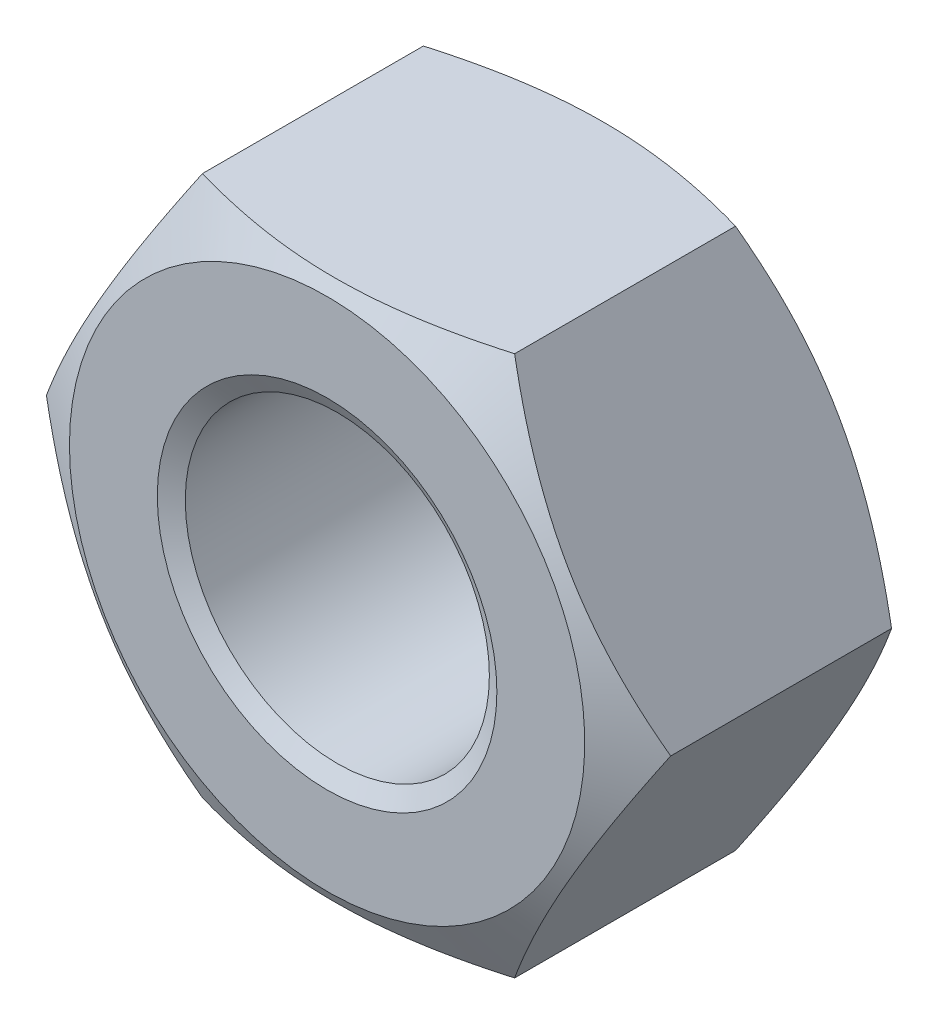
ISO-10303-21;
HEADER;
FILE_DESCRIPTION(('STEP AP214'),'2;1');
FILE_NAME('part.step','',(''),(''),'','','');
FILE_SCHEMA(('AUTOMOTIVE_DESIGN { 1 0 10303 214 1 1 1 1 }'));
ENDSEC;
DATA;
#1=APPLICATION_CONTEXT('core data for automotive mechanical design processes');
#2=APPLICATION_PROTOCOL_DEFINITION('international standard','automotive_design',2000,#1);
#3=PRODUCT_CONTEXT('',#1,'mechanical');
#4=PRODUCT('Part','Part','',(#3));
#5=PRODUCT_RELATED_PRODUCT_CATEGORY('part','',(#4));
#6=PRODUCT_DEFINITION_FORMATION('','',#4);
#7=PRODUCT_DEFINITION_CONTEXT('part definition',#1,'design');
#8=PRODUCT_DEFINITION('design','',#6,#7);
#9=PRODUCT_DEFINITION_SHAPE('','',#8);
#10=(LENGTH_UNIT() NAMED_UNIT(*) SI_UNIT(.MILLI.,.METRE.));
#11=(NAMED_UNIT(*) PLANE_ANGLE_UNIT() SI_UNIT($,.RADIAN.));
#12=(NAMED_UNIT(*) SI_UNIT($,.STERADIAN.) SOLID_ANGLE_UNIT());
#13=UNCERTAINTY_MEASURE_WITH_UNIT(LENGTH_MEASURE(1.E-05),#10,'distance_accuracy_value','');
#14=(GEOMETRIC_REPRESENTATION_CONTEXT(3) GLOBAL_UNCERTAINTY_ASSIGNED_CONTEXT((#13)) GLOBAL_UNIT_ASSIGNED_CONTEXT((#10,
#11,#12)) REPRESENTATION_CONTEXT('',''));
#15=CARTESIAN_POINT('',(0.,0.,0.));
#16=DIRECTION('',(0.,0.,1.));
#17=DIRECTION('',(1.,0.,0.));
#18=AXIS2_PLACEMENT_3D('',#15,#16,#17);
#19=CARTESIAN_POINT('',(-4.61880215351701,-8.,-8.4));
#20=DIRECTION('',(0.,-1.,0.));
#21=DIRECTION('',(0.,0.,-1.));
#22=AXIS2_PLACEMENT_3D('',#19,#20,#21);
#23=PLANE('',#22);
#24=CARTESIAN_POINT('',(-12.2197397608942,-8.,-4.03022141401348));
#25=CARTESIAN_POINT('',(-11.868727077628,-8.,-3.86071753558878));
#26=CARTESIAN_POINT('',(-11.5168810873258,-8.,-3.69290788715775));
#27=CARTESIAN_POINT('',(-10.811071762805,-8.,-3.36164590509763));
#28=CARTESIAN_POINT('',(-10.4571080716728,-8.,-3.19819433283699));
#29=CARTESIAN_POINT('',(-9.74468564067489,-8.,-2.87574971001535));
#30=CARTESIAN_POINT('',(-9.38621274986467,-8.,-2.71678781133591));
#31=CARTESIAN_POINT('',(-8.66630957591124,-8.,-2.40573517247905));
#32=CARTESIAN_POINT('',(-8.30487944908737,-8.,-2.25364407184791));
#33=CARTESIAN_POINT('',(-7.5741397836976,-8.,-1.95641301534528));
#34=CARTESIAN_POINT('',(-7.20478765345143,-8.,-1.81137718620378));
#35=CARTESIAN_POINT('',(-6.46171720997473,-8.,-1.53273971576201));
#36=CARTESIAN_POINT('',(-6.08799841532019,-8.,-1.39913934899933));
#37=CARTESIAN_POINT('',(-5.33637311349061,-8.,-1.14698509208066));
#38=CARTESIAN_POINT('',(-4.95847754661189,-8.,-1.02839894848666));
#39=CARTESIAN_POINT('',(-4.19732915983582,-8.,-0.810141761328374));
#40=CARTESIAN_POINT('',(-3.81407808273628,-8.,-0.710464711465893));
#41=CARTESIAN_POINT('',(-3.04188080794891,-8.,-0.534888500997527));
#42=CARTESIAN_POINT('',(-2.65293275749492,-8.,-0.458997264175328));
#43=CARTESIAN_POINT('',(-2.06611409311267,-8.,-0.366816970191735));
#44=CARTESIAN_POINT('',(-1.86991776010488,-8.,-0.339697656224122));
#45=CARTESIAN_POINT('',(-1.47661497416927,-8.,-0.293211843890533));
#46=CARTESIAN_POINT('',(-1.27950860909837,-8.,-0.273844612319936));
#47=CARTESIAN_POINT('',(-0.885886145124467,-8.,-0.243382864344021));
#48=CARTESIAN_POINT('',(-0.689373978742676,-8.,-0.232237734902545));
#49=CARTESIAN_POINT('',(-0.296054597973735,-8.,-0.218278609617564));
#50=CARTESIAN_POINT('',(-0.0992473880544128,-8.,-0.215464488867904));
#51=CARTESIAN_POINT('',(0.29425398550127,-8.,-0.21823428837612));
#52=CARTESIAN_POINT('',(0.490948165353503,-8.,-0.223815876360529));
#53=CARTESIAN_POINT('',(0.883931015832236,-8.,-0.243239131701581));
#54=CARTESIAN_POINT('',(1.08021966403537,-8.,-0.257081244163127));
#55=CARTESIAN_POINT('',(1.55678522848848,-8.,-0.300428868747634));
#56=CARTESIAN_POINT('',(1.83668887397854,-8.,-0.334118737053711));
#57=CARTESIAN_POINT('',(2.39428319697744,-8.,-0.416412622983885));
#58=CARTESIAN_POINT('',(2.67197353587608,-8.,-0.465018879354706));
#59=CARTESIAN_POINT('',(3.50221902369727,-8.,-0.630772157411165));
#60=CARTESIAN_POINT('',(4.05086138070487,-8.,-0.76774225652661));
#61=CARTESIAN_POINT('',(4.87147978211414,-8.,-1.00366640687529));
#62=CARTESIAN_POINT('',(5.14774973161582,-8.,-1.08853026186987));
#63=CARTESIAN_POINT('',(5.69762075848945,-8.,-1.26665801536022));
#64=CARTESIAN_POINT('',(5.97122159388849,-8.,-1.35992266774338));
#65=CARTESIAN_POINT('',(6.51438825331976,-8.,-1.55285819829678));
#66=CARTESIAN_POINT('',(6.7839681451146,-8.,-1.65248987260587));
#67=CARTESIAN_POINT('',(7.32083790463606,-8.,-1.85748379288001));
#68=CARTESIAN_POINT('',(7.58812853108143,-8.,-1.96284404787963));
#69=CARTESIAN_POINT('',(7.85445593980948,-8.,-2.07053145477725));
#70=B_SPLINE_CURVE_WITH_KNOTS('',3,(#24,#25,#26,#27,#28,#29,#30,#31,#32,#33,#34,#35,#36,#37,#38,
#39,#40,#41,#42,#43,#44,#45,#46,#47,#48,#49,#50,#51,#52,#53,#54,#55,#56,#57,#58,#59,#60,#61,#62,
#63,#64,#65,#66,#67,#68,#69),.UNSPECIFIED.,.F.,.F.,(4,2,2,2,2,2,2,2,2,2,2,2,2,2,2,2,2,2,2,2,2,2,
4),(0.,1.16940595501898,2.33901488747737,3.51536959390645,4.69166251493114,5.8819389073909,
7.07234778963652,8.26015441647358,9.44758311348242,10.6354069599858,11.2294630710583,
11.8234629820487,12.4137751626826,13.0040784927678,13.5942178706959,14.1843890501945,
15.0296797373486,15.8750973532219,17.5691968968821,18.4361612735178,19.3032035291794,
20.1653433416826,21.0271854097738),.UNSPECIFIED.);
#71=CARTESIAN_POINT('',(-4.61880215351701,-8.,-0.931037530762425));
#72=VERTEX_POINT('',#71);
#73=CARTESIAN_POINT('',(4.618802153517,-8.,-0.931037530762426));
#74=VERTEX_POINT('',#73);
#75=EDGE_CURVE('E56',#72,#74,#70,.T.);
#76=ORIENTED_EDGE('',*,*,#75,.F.);
#77=DIRECTION('',(0.,0.,1.));
#78=VECTOR('',#77,1.);
#79=CARTESIAN_POINT('',(-4.61880215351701,-8.,-8.4));
#80=LINE('',#79,#78);
#81=CARTESIAN_POINT('',(-4.618802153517,-8.,-7.46896246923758));
#82=VERTEX_POINT('',#81);
#83=EDGE_CURVE('E111',#82,#72,#80,.T.);
#84=ORIENTED_EDGE('',*,*,#83,.F.);
#85=CARTESIAN_POINT('',(-12.2197397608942,-8.,-4.36977858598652));
#86=CARTESIAN_POINT('',(-11.868727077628,-8.,-4.53928246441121));
#87=CARTESIAN_POINT('',(-11.5168810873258,-8.,-4.70709211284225));
#88=CARTESIAN_POINT('',(-10.811071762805,-8.,-5.03835409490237));
#89=CARTESIAN_POINT('',(-10.4571080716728,-8.,-5.20180566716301));
#90=CARTESIAN_POINT('',(-9.74468564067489,-8.,-5.52425028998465));
#91=CARTESIAN_POINT('',(-9.38621274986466,-8.,-5.6832121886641));
#92=CARTESIAN_POINT('',(-8.66630957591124,-8.,-5.99426482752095));
#93=CARTESIAN_POINT('',(-8.30487944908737,-8.,-6.1463559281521));
#94=CARTESIAN_POINT('',(-7.5741397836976,-8.,-6.44358698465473));
#95=CARTESIAN_POINT('',(-7.20478765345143,-8.,-6.58862281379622));
#96=CARTESIAN_POINT('',(-6.46171720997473,-8.,-6.86726028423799));
#97=CARTESIAN_POINT('',(-6.08799841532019,-8.,-7.00086065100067));
#98=CARTESIAN_POINT('',(-5.33637311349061,-8.,-7.25301490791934));
#99=CARTESIAN_POINT('',(-4.95847754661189,-8.,-7.37160105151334));
#100=CARTESIAN_POINT('',(-4.19732915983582,-8.,-7.58985823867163));
#101=CARTESIAN_POINT('',(-3.81407808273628,-8.,-7.68953528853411));
#102=CARTESIAN_POINT('',(-3.04188080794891,-8.,-7.86511149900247));
#103=CARTESIAN_POINT('',(-2.65293275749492,-8.,-7.94100273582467));
#104=CARTESIAN_POINT('',(-2.06611409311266,-8.,-8.03318302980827));
#105=CARTESIAN_POINT('',(-1.86991776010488,-8.,-8.06030234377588));
#106=CARTESIAN_POINT('',(-1.47661497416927,-8.,-8.10678815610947));
#107=CARTESIAN_POINT('',(-1.27950860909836,-8.,-8.12615538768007));
#108=CARTESIAN_POINT('',(-0.885886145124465,-8.,-8.15661713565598));
#109=CARTESIAN_POINT('',(-0.689373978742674,-8.,-8.16776226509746));
#110=CARTESIAN_POINT('',(-0.296054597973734,-8.,-8.18172139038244));
#111=CARTESIAN_POINT('',(-0.0992473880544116,-8.,-8.1845355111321));
#112=CARTESIAN_POINT('',(0.294253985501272,-8.,-8.18176571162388));
#113=CARTESIAN_POINT('',(0.490948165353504,-8.,-8.17618412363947));
#114=CARTESIAN_POINT('',(0.883931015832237,-8.,-8.15676086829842));
#115=CARTESIAN_POINT('',(1.08021966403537,-8.,-8.14291875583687));
#116=CARTESIAN_POINT('',(1.55678522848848,-8.,-8.09957113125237));
#117=CARTESIAN_POINT('',(1.83668887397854,-8.,-8.06588126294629));
#118=CARTESIAN_POINT('',(2.39428319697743,-8.,-7.98358737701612));
#119=CARTESIAN_POINT('',(2.67197353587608,-8.,-7.9349811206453));
#120=CARTESIAN_POINT('',(3.50221902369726,-8.,-7.76922784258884));
#121=CARTESIAN_POINT('',(4.05086138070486,-8.,-7.63225774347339));
#122=CARTESIAN_POINT('',(4.87147978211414,-8.,-7.39633359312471));
#123=CARTESIAN_POINT('',(5.14774973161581,-8.,-7.31146973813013));
#124=CARTESIAN_POINT('',(5.69762075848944,-8.,-7.13334198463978));
#125=CARTESIAN_POINT('',(5.97122159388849,-8.,-7.04007733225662));
#126=CARTESIAN_POINT('',(6.51438825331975,-8.,-6.84714180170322));
#127=CARTESIAN_POINT('',(6.78396814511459,-8.,-6.74751012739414));
#128=CARTESIAN_POINT('',(7.32083790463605,-8.,-6.54251620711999));
#129=CARTESIAN_POINT('',(7.58812853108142,-8.,-6.43715595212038));
#130=CARTESIAN_POINT('',(7.85445593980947,-8.,-6.32946854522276));
#131=B_SPLINE_CURVE_WITH_KNOTS('',3,(#85,#86,#87,#88,#89,#90,#91,#92,#93,#94,#95,#96,#97,#98,
#99,#100,#101,#102,#103,#104,#105,#106,#107,#108,#109,#110,#111,#112,#113,#114,#115,#116,#117,
#118,#119,#120,#121,#122,#123,#124,#125,#126,#127,#128,#129,#130),.UNSPECIFIED.,.F.,.F.,(4,2,2,
2,2,2,2,2,2,2,2,2,2,2,2,2,2,2,2,2,2,2,4),(0.,1.16940595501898,2.33901488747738,3.51536959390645,
4.69166251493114,5.8819389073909,7.07234778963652,8.26015441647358,9.44758311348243,
10.6354069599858,11.2294630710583,11.8234629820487,12.4137751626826,13.0040784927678,
13.5942178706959,14.1843890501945,15.0296797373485,15.8750973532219,17.5691968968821,
18.4361612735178,19.3032035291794,20.1653433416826,21.0271854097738),.UNSPECIFIED.);
#132=CARTESIAN_POINT('',(4.618802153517,-8.00000000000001,-7.46896246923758));
#133=VERTEX_POINT('',#132);
#134=EDGE_CURVE('E132',#133,#82,#131,.F.);
#135=ORIENTED_EDGE('',*,*,#134,.F.);
#136=DIRECTION('',(0.,0.,1.));
#137=VECTOR('',#136,1.);
#138=CARTESIAN_POINT('',(4.618802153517,-8.,-8.4));
#139=LINE('',#138,#137);
#140=EDGE_CURVE('E129',#133,#74,#139,.T.);
#141=ORIENTED_EDGE('',*,*,#140,.T.);
#142=EDGE_LOOP('',(#76,#84,#135,#141));
#143=FACE_BOUND('',#142,.T.);
#144=ADVANCED_FACE('F41',(#143),#23,.T.);
#145=CARTESIAN_POINT('',(-9.23760430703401,0.,-8.4));
#146=DIRECTION('',(-0.866025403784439,-0.5,0.));
#147=DIRECTION('',(0.5,-0.866025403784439,0.));
#148=AXIS2_PLACEMENT_3D('',#145,#146,#147);
#149=PLANE('',#148);
#150=CARTESIAN_POINT('',(-9.23771977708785,0.000200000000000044,-0.931104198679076));
#151=CARTESIAN_POINT('',(-9.13619343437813,-0.175648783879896,-0.872497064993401));
#152=CARTESIAN_POINT('',(-9.03428856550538,-0.352153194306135,-0.816549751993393));
#153=CARTESIAN_POINT('',(-8.82965122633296,-0.706595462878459,-0.71070735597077));
#154=CARTESIAN_POINT('',(-8.72691841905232,-0.884533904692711,-0.66081488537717));
#155=CARTESIAN_POINT('',(-8.41707512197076,-1.42119823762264,-0.521199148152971));
#156=CARTESIAN_POINT('',(-8.20874154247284,-1.78204258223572,-0.441787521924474));
#157=CARTESIAN_POINT('',(-7.89697436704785,-2.32203917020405,-0.348667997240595));
#158=CARTESIAN_POINT('',(-7.79447216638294,-2.49957818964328,-0.322140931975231));
#159=CARTESIAN_POINT('',(-7.58900421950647,-2.8554591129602,-0.277659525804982));
#160=CARTESIAN_POINT('',(-7.4860385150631,-3.03380094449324,-0.259704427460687));
#161=CARTESIAN_POINT('',(-7.27992981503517,-3.39079168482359,-0.232821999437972));
#162=CARTESIAN_POINT('',(-7.17678715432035,-3.5694400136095,-0.22388442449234));
#163=CARTESIAN_POINT('',(-6.97040655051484,-3.92690170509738,-0.215228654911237));
#164=CARTESIAN_POINT('',(-6.86716861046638,-4.10571506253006,-0.215510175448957));
#165=CARTESIAN_POINT('',(-6.67416139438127,-4.4400133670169,-0.224651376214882));
#166=CARTESIAN_POINT('',(-6.58437849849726,-4.59552190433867,-0.232395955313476));
#167=CARTESIAN_POINT('',(-6.40502298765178,-4.90617476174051,-0.254707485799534));
#168=CARTESIAN_POINT('',(-6.31545038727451,-5.06131905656,-0.269274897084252));
#169=CARTESIAN_POINT('',(-6.04707935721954,-5.52615131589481,-0.322867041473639));
#170=CARTESIAN_POINT('',(-5.86875596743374,-5.83501648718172,-0.371774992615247));
#171=CARTESIAN_POINT('',(-5.51021755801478,-6.45602322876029,-0.494045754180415));
#172=CARTESIAN_POINT('',(-5.33004829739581,-6.76808554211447,-0.5679268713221));
#173=CARTESIAN_POINT('',(-4.97239658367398,-7.38755648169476,-0.73560649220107));
#174=CARTESIAN_POINT('',(-4.79490955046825,-7.69497304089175,-0.829365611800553));
#175=CARTESIAN_POINT('',(-4.61868668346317,-8.0002,-0.931104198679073));
#176=B_SPLINE_CURVE_WITH_KNOTS('',3,(#150,#151,#152,#153,#154,#155,#156,#157,#158,#159,#160,
#161,#162,#163,#164,#165,#166,#167,#168,#169,#170,#171,#172,#173,#174,#175),.UNSPECIFIED.,.F.,
.F.,(4,2,2,2,2,2,2,2,2,2,2,2,4),(0.,0.633973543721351,1.26821965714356,2.53934712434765,
3.15934343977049,3.77928496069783,4.39852133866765,5.01773858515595,5.55680239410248,
6.09590254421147,7.17487077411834,8.27776850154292,9.37850115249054),.UNSPECIFIED.);
#177=CARTESIAN_POINT('',(-9.23760430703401,0.,-0.931037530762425));
#178=VERTEX_POINT('',#177);
#179=EDGE_CURVE('E96',#178,#72,#176,.T.);
#180=ORIENTED_EDGE('',*,*,#179,.F.);
#181=DIRECTION('',(0.,0.,1.));
#182=VECTOR('',#181,1.);
#183=CARTESIAN_POINT('',(-9.23760430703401,0.,-8.4));
#184=LINE('',#183,#182);
#185=CARTESIAN_POINT('',(-9.23760430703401,0.,-7.46896246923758));
#186=VERTEX_POINT('',#185);
#187=EDGE_CURVE('E109',#186,#178,#184,.T.);
#188=ORIENTED_EDGE('',*,*,#187,.F.);
#189=CARTESIAN_POINT('',(-4.61868668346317,-8.0002,-7.46889580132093));
#190=CARTESIAN_POINT('',(-4.72021302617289,-7.8243512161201,-7.5275029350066));
#191=CARTESIAN_POINT('',(-4.82211789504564,-7.64784680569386,-7.58345024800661));
#192=CARTESIAN_POINT('',(-5.02675523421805,-7.29340453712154,-7.68929264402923));
#193=CARTESIAN_POINT('',(-5.12948804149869,-7.11546609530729,-7.73918511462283));
#194=CARTESIAN_POINT('',(-5.43933133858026,-6.57880176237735,-7.87880085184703));
#195=CARTESIAN_POINT('',(-5.64766491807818,-6.21795741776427,-7.95821247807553));
#196=CARTESIAN_POINT('',(-5.95943209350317,-5.67796082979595,-8.05133200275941));
#197=CARTESIAN_POINT('',(-6.06193429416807,-5.50042181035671,-8.07785906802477));
#198=CARTESIAN_POINT('',(-6.26740224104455,-5.1445408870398,-8.12234047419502));
#199=CARTESIAN_POINT('',(-6.37036794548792,-4.96619905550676,-8.14029557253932));
#200=CARTESIAN_POINT('',(-6.57647664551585,-4.60920831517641,-8.16717800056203));
#201=CARTESIAN_POINT('',(-6.67961930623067,-4.4305599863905,-8.17611557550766));
#202=CARTESIAN_POINT('',(-6.88599991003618,-4.07309829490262,-8.18477134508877));
#203=CARTESIAN_POINT('',(-6.98923785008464,-3.89428493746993,-8.18448982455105));
#204=CARTESIAN_POINT('',(-7.18224506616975,-3.5599866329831,-8.17534862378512));
#205=CARTESIAN_POINT('',(-7.27202796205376,-3.40447809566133,-8.16760404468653));
#206=CARTESIAN_POINT('',(-7.45138347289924,-3.09382523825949,-8.14529251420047));
#207=CARTESIAN_POINT('',(-7.5409560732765,-2.93868094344,-8.13072510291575));
#208=CARTESIAN_POINT('',(-7.80932710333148,-2.47384868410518,-8.07713295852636));
#209=CARTESIAN_POINT('',(-7.98765049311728,-2.16498351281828,-8.02822500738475));
#210=CARTESIAN_POINT('',(-8.34618890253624,-1.5439767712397,-7.90595424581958));
#211=CARTESIAN_POINT('',(-8.52635816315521,-1.23191445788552,-7.8320731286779));
#212=CARTESIAN_POINT('',(-8.88400987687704,-0.612443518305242,-7.66439350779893));
#213=CARTESIAN_POINT('',(-9.06149691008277,-0.30502695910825,-7.57063438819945));
#214=CARTESIAN_POINT('',(-9.23771977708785,0.000199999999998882,-7.46889580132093));
#215=B_SPLINE_CURVE_WITH_KNOTS('',3,(#189,#190,#191,#192,#193,#194,#195,#196,#197,#198,#199,
#200,#201,#202,#203,#204,#205,#206,#207,#208,#209,#210,#211,#212,#213,#214),.UNSPECIFIED.,.F.,
.F.,(4,2,2,2,2,2,2,2,2,2,2,2,4),(0.,0.633973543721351,1.26821965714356,2.53934712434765,
3.15934343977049,3.77928496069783,4.39852133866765,5.01773858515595,5.55680239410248,
6.09590254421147,7.17487077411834,8.27776850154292,9.37850115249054),.UNSPECIFIED.);
#216=EDGE_CURVE('E205',#82,#186,#215,.T.);
#217=ORIENTED_EDGE('',*,*,#216,.F.);
#218=ORIENTED_EDGE('',*,*,#83,.T.);
#219=EDGE_LOOP('',(#180,#188,#217,#218));
#220=FACE_BOUND('',#219,.T.);
#221=ADVANCED_FACE('F107',(#220),#149,.T.);
#222=CARTESIAN_POINT('',(-4.61880215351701,8.,-8.4));
#223=DIRECTION('',(-0.866025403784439,0.5,0.));
#224=DIRECTION('',(-0.5,-0.866025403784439,0.));
#225=AXIS2_PLACEMENT_3D('',#222,#223,#224);
#226=PLANE('',#225);
#227=CARTESIAN_POINT('',(-4.61868668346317,8.0002,-0.931104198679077));
#228=CARTESIAN_POINT('',(-4.72021302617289,7.82435121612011,-0.872497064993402));
#229=CARTESIAN_POINT('',(-4.82211789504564,7.64784680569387,-0.816549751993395));
#230=CARTESIAN_POINT('',(-5.02675523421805,7.29340453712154,-0.710707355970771));
#231=CARTESIAN_POINT('',(-5.12948804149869,7.11546609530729,-0.660814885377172));
#232=CARTESIAN_POINT('',(-5.43933133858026,6.57880176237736,-0.521199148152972));
#233=CARTESIAN_POINT('',(-5.64766491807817,6.21795741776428,-0.441787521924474));
#234=CARTESIAN_POINT('',(-5.95943209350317,5.67796082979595,-0.348667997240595));
#235=CARTESIAN_POINT('',(-6.06193429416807,5.50042181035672,-0.322140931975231));
#236=CARTESIAN_POINT('',(-6.26740224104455,5.14454088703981,-0.277659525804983));
#237=CARTESIAN_POINT('',(-6.37036794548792,4.96619905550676,-0.259704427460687));
#238=CARTESIAN_POINT('',(-6.57647664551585,4.60920831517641,-0.232821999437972));
#239=CARTESIAN_POINT('',(-6.67961930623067,4.4305599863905,-0.223884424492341));
#240=CARTESIAN_POINT('',(-6.88599991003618,4.07309829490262,-0.215228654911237));
#241=CARTESIAN_POINT('',(-6.98923785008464,3.89428493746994,-0.215510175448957));
#242=CARTESIAN_POINT('',(-7.18224506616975,3.5599866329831,-0.224651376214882));
#243=CARTESIAN_POINT('',(-7.27202796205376,3.40447809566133,-0.232395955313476));
#244=CARTESIAN_POINT('',(-7.45138347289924,3.09382523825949,-0.254707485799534));
#245=CARTESIAN_POINT('',(-7.5409560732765,2.93868094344,-0.269274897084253));
#246=CARTESIAN_POINT('',(-7.80932710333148,2.47384868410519,-0.322867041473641));
#247=CARTESIAN_POINT('',(-7.98765049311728,2.16498351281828,-0.371774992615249));
#248=CARTESIAN_POINT('',(-8.34618890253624,1.5439767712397,-0.494045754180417));
#249=CARTESIAN_POINT('',(-8.52635816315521,1.23191445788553,-0.567926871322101));
#250=CARTESIAN_POINT('',(-8.88400987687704,0.612443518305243,-0.735606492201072));
#251=CARTESIAN_POINT('',(-9.06149691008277,0.305026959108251,-0.829365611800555));
#252=CARTESIAN_POINT('',(-9.23771977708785,-0.000199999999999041,-0.931104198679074));
#253=B_SPLINE_CURVE_WITH_KNOTS('',3,(#227,#228,#229,#230,#231,#232,#233,#234,#235,#236,#237,
#238,#239,#240,#241,#242,#243,#244,#245,#246,#247,#248,#249,#250,#251,#252),.UNSPECIFIED.,.F.,
.F.,(4,2,2,2,2,2,2,2,2,2,2,2,4),(0.,0.633973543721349,1.26821965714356,2.53934712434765,
3.15934343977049,3.77928496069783,4.39852133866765,5.01773858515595,5.55680239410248,
6.09590254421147,7.17487077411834,8.27776850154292,9.37850115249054),.UNSPECIFIED.);
#254=CARTESIAN_POINT('',(-4.618802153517,8.,-0.931037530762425));
#255=VERTEX_POINT('',#254);
#256=EDGE_CURVE('E92',#255,#178,#253,.T.);
#257=ORIENTED_EDGE('',*,*,#256,.F.);
#258=DIRECTION('',(0.,0.,1.));
#259=VECTOR('',#258,1.);
#260=CARTESIAN_POINT('',(-4.61880215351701,8.,-8.4));
#261=LINE('',#260,#259);
#262=CARTESIAN_POINT('',(-4.61880215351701,8.,-7.46896246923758));
#263=VERTEX_POINT('',#262);
#264=EDGE_CURVE('E116',#263,#255,#261,.T.);
#265=ORIENTED_EDGE('',*,*,#264,.F.);
#266=CARTESIAN_POINT('',(-9.23771977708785,-0.000199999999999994,-7.46889580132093));
#267=CARTESIAN_POINT('',(-9.13619343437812,0.175648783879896,-7.5275029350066));
#268=CARTESIAN_POINT('',(-9.03428856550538,0.352153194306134,-7.58345024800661));
#269=CARTESIAN_POINT('',(-8.82965122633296,0.706595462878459,-7.68929264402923));
#270=CARTESIAN_POINT('',(-8.72691841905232,0.884533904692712,-7.73918511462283));
#271=CARTESIAN_POINT('',(-8.41707512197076,1.42119823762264,-7.87880085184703));
#272=CARTESIAN_POINT('',(-8.20874154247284,1.78204258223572,-7.95821247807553));
#273=CARTESIAN_POINT('',(-7.89697436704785,2.32203917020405,-8.05133200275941));
#274=CARTESIAN_POINT('',(-7.79447216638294,2.49957818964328,-8.07785906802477));
#275=CARTESIAN_POINT('',(-7.58900421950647,2.8554591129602,-8.12234047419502));
#276=CARTESIAN_POINT('',(-7.4860385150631,3.03380094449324,-8.14029557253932));
#277=CARTESIAN_POINT('',(-7.27992981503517,3.39079168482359,-8.16717800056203));
#278=CARTESIAN_POINT('',(-7.17678715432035,3.5694400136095,-8.17611557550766));
#279=CARTESIAN_POINT('',(-6.97040655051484,3.92690170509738,-8.18477134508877));
#280=CARTESIAN_POINT('',(-6.86716861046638,4.10571506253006,-8.18448982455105));
#281=CARTESIAN_POINT('',(-6.67416139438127,4.4400133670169,-8.17534862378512));
#282=CARTESIAN_POINT('',(-6.58437849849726,4.59552190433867,-8.16760404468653));
#283=CARTESIAN_POINT('',(-6.40502298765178,4.90617476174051,-8.14529251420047));
#284=CARTESIAN_POINT('',(-6.31545038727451,5.06131905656,-8.13072510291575));
#285=CARTESIAN_POINT('',(-6.04707935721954,5.52615131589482,-8.07713295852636));
#286=CARTESIAN_POINT('',(-5.86875596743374,5.83501648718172,-8.02822500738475));
#287=CARTESIAN_POINT('',(-5.51021755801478,6.4560232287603,-7.90595424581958));
#288=CARTESIAN_POINT('',(-5.33004829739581,6.76808554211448,-7.8320731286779));
#289=CARTESIAN_POINT('',(-4.97239658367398,7.38755648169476,-7.66439350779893));
#290=CARTESIAN_POINT('',(-4.79490955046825,7.69497304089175,-7.57063438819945));
#291=CARTESIAN_POINT('',(-4.61868668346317,8.0002,-7.46889580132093));
#292=B_SPLINE_CURVE_WITH_KNOTS('',3,(#266,#267,#268,#269,#270,#271,#272,#273,#274,#275,#276,
#277,#278,#279,#280,#281,#282,#283,#284,#285,#286,#287,#288,#289,#290,#291),.UNSPECIFIED.,.F.,
.F.,(4,2,2,2,2,2,2,2,2,2,2,2,4),(0.,0.63397354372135,1.26821965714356,2.53934712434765,
3.15934343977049,3.77928496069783,4.39852133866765,5.01773858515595,5.55680239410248,
6.09590254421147,7.17487077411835,8.27776850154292,9.37850115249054),.UNSPECIFIED.);
#293=EDGE_CURVE('E115',#186,#263,#292,.T.);
#294=ORIENTED_EDGE('',*,*,#293,.F.);
#295=ORIENTED_EDGE('',*,*,#187,.T.);
#296=EDGE_LOOP('',(#257,#265,#294,#295));
#297=FACE_BOUND('',#296,.T.);
#298=ADVANCED_FACE('F114',(#297),#226,.T.);
#299=CARTESIAN_POINT('',(4.618802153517,8.,-8.4));
#300=DIRECTION('',(0.,1.,0.));
#301=DIRECTION('',(0.,0.,1.));
#302=AXIS2_PLACEMENT_3D('',#299,#300,#301);
#303=PLANE('',#302);
#304=CARTESIAN_POINT('',(-12.2197397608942,8.,-4.03022141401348));
#305=CARTESIAN_POINT('',(-11.868727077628,8.,-3.86071753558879));
#306=CARTESIAN_POINT('',(-11.5168810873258,8.,-3.69290788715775));
#307=CARTESIAN_POINT('',(-10.811071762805,8.,-3.36164590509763));
#308=CARTESIAN_POINT('',(-10.4571080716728,8.,-3.19819433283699));
#309=CARTESIAN_POINT('',(-9.74468564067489,8.,-2.87574971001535));
#310=CARTESIAN_POINT('',(-9.38621274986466,8.,-2.71678781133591));
#311=CARTESIAN_POINT('',(-8.66630957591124,8.,-2.40573517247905));
#312=CARTESIAN_POINT('',(-8.30487944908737,8.,-2.25364407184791));
#313=CARTESIAN_POINT('',(-7.5741397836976,8.,-1.95641301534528));
#314=CARTESIAN_POINT('',(-7.20478765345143,8.,-1.81137718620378));
#315=CARTESIAN_POINT('',(-6.46171720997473,8.,-1.53273971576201));
#316=CARTESIAN_POINT('',(-6.08799841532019,8.,-1.39913934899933));
#317=CARTESIAN_POINT('',(-5.33637311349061,8.,-1.14698509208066));
#318=CARTESIAN_POINT('',(-4.95847754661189,8.,-1.02839894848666));
#319=CARTESIAN_POINT('',(-4.19732915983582,8.,-0.810141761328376));
#320=CARTESIAN_POINT('',(-3.81407808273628,8.,-0.710464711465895));
#321=CARTESIAN_POINT('',(-3.04188080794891,8.,-0.534888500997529));
#322=CARTESIAN_POINT('',(-2.65293275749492,8.,-0.458997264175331));
#323=CARTESIAN_POINT('',(-2.06611409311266,8.,-0.366816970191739));
#324=CARTESIAN_POINT('',(-1.86991776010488,8.,-0.339697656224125));
#325=CARTESIAN_POINT('',(-1.47661497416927,8.,-0.293211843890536));
#326=CARTESIAN_POINT('',(-1.27950860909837,8.,-0.273844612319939));
#327=CARTESIAN_POINT('',(-0.885886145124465,8.,-0.243382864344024));
#328=CARTESIAN_POINT('',(-0.689373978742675,8.,-0.232237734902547));
#329=CARTESIAN_POINT('',(-0.296054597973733,8.,-0.218278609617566));
#330=CARTESIAN_POINT('',(-0.0992473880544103,8.,-0.215464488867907));
#331=CARTESIAN_POINT('',(0.294253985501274,8.,-0.218234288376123));
#332=CARTESIAN_POINT('',(0.490948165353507,8.,-0.223815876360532));
#333=CARTESIAN_POINT('',(0.88393101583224,8.,-0.243239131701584));
#334=CARTESIAN_POINT('',(1.08021966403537,8.,-0.25708124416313));
#335=CARTESIAN_POINT('',(1.55678522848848,8.,-0.300428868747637));
#336=CARTESIAN_POINT('',(1.83668887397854,8.,-0.334118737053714));
#337=CARTESIAN_POINT('',(2.39428319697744,8.,-0.416412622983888));
#338=CARTESIAN_POINT('',(2.67197353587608,8.,-0.465018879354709));
#339=CARTESIAN_POINT('',(3.50221902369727,8.,-0.630772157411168));
#340=CARTESIAN_POINT('',(4.05086138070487,8.,-0.767742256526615));
#341=CARTESIAN_POINT('',(4.87147978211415,8.,-1.0036664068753));
#342=CARTESIAN_POINT('',(5.14774973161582,8.,-1.08853026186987));
#343=CARTESIAN_POINT('',(5.69762075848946,8.,-1.26665801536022));
#344=CARTESIAN_POINT('',(5.9712215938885,8.,-1.35992266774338));
#345=CARTESIAN_POINT('',(6.51438825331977,8.,-1.55285819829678));
#346=CARTESIAN_POINT('',(6.7839681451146,8.,-1.65248987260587));
#347=CARTESIAN_POINT('',(7.32083790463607,8.,-1.85748379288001));
#348=CARTESIAN_POINT('',(7.58812853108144,8.,-1.96284404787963));
#349=CARTESIAN_POINT('',(7.85445593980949,8.,-2.07053145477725));
#350=B_SPLINE_CURVE_WITH_KNOTS('',3,(#304,#305,#306,#307,#308,#309,#310,#311,#312,#313,#314,
#315,#316,#317,#318,#319,#320,#321,#322,#323,#324,#325,#326,#327,#328,#329,#330,#331,#332,#333,
#334,#335,#336,#337,#338,#339,#340,#341,#342,#343,#344,#345,#346,#347,#348,#349),.UNSPECIFIED.,
.F.,.F.,(4,2,2,2,2,2,2,2,2,2,2,2,2,2,2,2,2,2,2,2,2,2,4),(0.,1.16940595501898,2.33901488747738,
3.51536959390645,4.69166251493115,5.88193890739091,7.07234778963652,8.26015441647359,
9.44758311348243,10.6354069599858,11.2294630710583,11.8234629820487,12.4137751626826,
13.0040784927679,13.594217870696,14.1843890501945,15.0296797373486,15.8750973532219,
17.5691968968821,18.4361612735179,19.3032035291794,20.1653433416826,21.0271854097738),.UNSPECIFIED.);
#351=CARTESIAN_POINT('',(4.618802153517,8.00000000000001,-0.931037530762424));
#352=VERTEX_POINT('',#351);
#353=EDGE_CURVE('E98',#352,#255,#350,.F.);
#354=ORIENTED_EDGE('',*,*,#353,.F.);
#355=DIRECTION('',(0.,0.,1.));
#356=VECTOR('',#355,1.);
#357=CARTESIAN_POINT('',(4.618802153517,8.,-8.4));
#358=LINE('',#357,#356);
#359=CARTESIAN_POINT('',(4.618802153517,8.00000000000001,-7.46896246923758));
#360=VERTEX_POINT('',#359);
#361=EDGE_CURVE('E120',#360,#352,#358,.T.);
#362=ORIENTED_EDGE('',*,*,#361,.F.);
#363=CARTESIAN_POINT('',(-12.2197397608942,8.,-4.36977858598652));
#364=CARTESIAN_POINT('',(-11.868727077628,8.,-4.53928246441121));
#365=CARTESIAN_POINT('',(-11.5168810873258,8.,-4.70709211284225));
#366=CARTESIAN_POINT('',(-10.811071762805,8.,-5.03835409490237));
#367=CARTESIAN_POINT('',(-10.4571080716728,8.,-5.20180566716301));
#368=CARTESIAN_POINT('',(-9.74468564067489,8.,-5.52425028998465));
#369=CARTESIAN_POINT('',(-9.38621274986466,8.,-5.68321218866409));
#370=CARTESIAN_POINT('',(-8.66630957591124,8.,-5.99426482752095));
#371=CARTESIAN_POINT('',(-8.30487944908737,8.,-6.14635592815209));
#372=CARTESIAN_POINT('',(-7.5741397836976,8.,-6.44358698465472));
#373=CARTESIAN_POINT('',(-7.20478765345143,8.,-6.58862281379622));
#374=CARTESIAN_POINT('',(-6.46171720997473,8.,-6.86726028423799));
#375=CARTESIAN_POINT('',(-6.08799841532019,8.,-7.00086065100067));
#376=CARTESIAN_POINT('',(-5.33637311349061,8.,-7.25301490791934));
#377=CARTESIAN_POINT('',(-4.95847754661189,8.,-7.37160105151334));
#378=CARTESIAN_POINT('',(-4.19732915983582,8.,-7.58985823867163));
#379=CARTESIAN_POINT('',(-3.81407808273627,8.,-7.68953528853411));
#380=CARTESIAN_POINT('',(-3.04188080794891,8.,-7.86511149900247));
#381=CARTESIAN_POINT('',(-2.65293275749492,8.,-7.94100273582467));
#382=CARTESIAN_POINT('',(-2.06611409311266,8.,-8.03318302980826));
#383=CARTESIAN_POINT('',(-1.86991776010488,8.,-8.06030234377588));
#384=CARTESIAN_POINT('',(-1.47661497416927,8.,-8.10678815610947));
#385=CARTESIAN_POINT('',(-1.27950860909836,8.,-8.12615538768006));
#386=CARTESIAN_POINT('',(-0.885886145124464,8.,-8.15661713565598));
#387=CARTESIAN_POINT('',(-0.689373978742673,8.,-8.16776226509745));
#388=CARTESIAN_POINT('',(-0.296054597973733,8.,-8.18172139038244));
#389=CARTESIAN_POINT('',(-0.0992473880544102,8.,-8.1845355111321));
#390=CARTESIAN_POINT('',(0.294253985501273,8.,-8.18176571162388));
#391=CARTESIAN_POINT('',(0.490948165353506,8.,-8.17618412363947));
#392=CARTESIAN_POINT('',(0.883931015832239,8.,-8.15676086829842));
#393=CARTESIAN_POINT('',(1.08021966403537,8.,-8.14291875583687));
#394=CARTESIAN_POINT('',(1.55678522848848,8.,-8.09957113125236));
#395=CARTESIAN_POINT('',(1.83668887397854,8.,-8.06588126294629));
#396=CARTESIAN_POINT('',(2.39428319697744,8.,-7.98358737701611));
#397=CARTESIAN_POINT('',(2.67197353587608,8.,-7.93498112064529));
#398=CARTESIAN_POINT('',(3.50221902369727,8.,-7.76922784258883));
#399=CARTESIAN_POINT('',(4.05086138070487,8.,-7.63225774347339));
#400=CARTESIAN_POINT('',(4.87147978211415,8.,-7.3963335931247));
#401=CARTESIAN_POINT('',(5.14774973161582,8.,-7.31146973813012));
#402=CARTESIAN_POINT('',(5.69762075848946,8.,-7.13334198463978));
#403=CARTESIAN_POINT('',(5.9712215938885,8.,-7.04007733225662));
#404=CARTESIAN_POINT('',(6.51438825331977,8.,-6.84714180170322));
#405=CARTESIAN_POINT('',(6.7839681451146,8.,-6.74751012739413));
#406=CARTESIAN_POINT('',(7.32083790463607,8.,-6.54251620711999));
#407=CARTESIAN_POINT('',(7.58812853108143,8.,-6.43715595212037));
#408=CARTESIAN_POINT('',(7.85445593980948,8.,-6.32946854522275));
#409=B_SPLINE_CURVE_WITH_KNOTS('',3,(#363,#364,#365,#366,#367,#368,#369,#370,#371,#372,#373,
#374,#375,#376,#377,#378,#379,#380,#381,#382,#383,#384,#385,#386,#387,#388,#389,#390,#391,#392,
#393,#394,#395,#396,#397,#398,#399,#400,#401,#402,#403,#404,#405,#406,#407,#408),.UNSPECIFIED.,
.F.,.F.,(4,2,2,2,2,2,2,2,2,2,2,2,2,2,2,2,2,2,2,2,2,2,4),(0.,1.16940595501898,2.33901488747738,
3.51536959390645,4.69166251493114,5.8819389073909,7.07234778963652,8.26015441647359,
9.44758311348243,10.6354069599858,11.2294630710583,11.8234629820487,12.4137751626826,
13.0040784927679,13.5942178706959,14.1843890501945,15.0296797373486,15.8750973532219,
17.5691968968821,18.4361612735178,19.3032035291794,20.1653433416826,21.0271854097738),.UNSPECIFIED.);
#410=EDGE_CURVE('E192',#263,#360,#409,.T.);
#411=ORIENTED_EDGE('',*,*,#410,.F.);
#412=ORIENTED_EDGE('',*,*,#264,.T.);
#413=EDGE_LOOP('',(#354,#362,#411,#412));
#414=FACE_BOUND('',#413,.T.);
#415=ADVANCED_FACE('F240',(#414),#303,.T.);
#416=CARTESIAN_POINT('',(9.23760430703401,0.,-8.4));
#417=DIRECTION('',(0.866025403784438,0.5,0.));
#418=DIRECTION('',(-0.5,0.866025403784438,0.));
#419=AXIS2_PLACEMENT_3D('',#416,#417,#418);
#420=PLANE('',#419);
#421=CARTESIAN_POINT('',(9.23771977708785,-0.000199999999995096,-0.931104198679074));
#422=CARTESIAN_POINT('',(9.13619343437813,0.175648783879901,-0.8724970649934));
#423=CARTESIAN_POINT('',(9.03428856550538,0.352153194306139,-0.816549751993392));
#424=CARTESIAN_POINT('',(8.82965122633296,0.706595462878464,-0.710707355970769));
#425=CARTESIAN_POINT('',(8.72691841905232,0.884533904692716,-0.66081488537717));
#426=CARTESIAN_POINT('',(8.41707512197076,1.42119823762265,-0.52119914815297));
#427=CARTESIAN_POINT('',(8.20874154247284,1.78204258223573,-0.441787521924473));
#428=CARTESIAN_POINT('',(7.89697436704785,2.32203917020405,-0.348667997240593));
#429=CARTESIAN_POINT('',(7.79447216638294,2.49957818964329,-0.322140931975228));
#430=CARTESIAN_POINT('',(7.58900421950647,2.8554591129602,-0.27765952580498));
#431=CARTESIAN_POINT('',(7.4860385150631,3.03380094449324,-0.259704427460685));
#432=CARTESIAN_POINT('',(7.27992981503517,3.3907916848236,-0.23282199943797));
#433=CARTESIAN_POINT('',(7.17678715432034,3.5694400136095,-0.223884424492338));
#434=CARTESIAN_POINT('',(6.97040655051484,3.92690170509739,-0.215228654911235));
#435=CARTESIAN_POINT('',(6.86716861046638,4.10571506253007,-0.215510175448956));
#436=CARTESIAN_POINT('',(6.67416139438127,4.44001336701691,-0.224651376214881));
#437=CARTESIAN_POINT('',(6.58437849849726,4.59552190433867,-0.232395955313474));
#438=CARTESIAN_POINT('',(6.40502298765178,4.90617476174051,-0.254707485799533));
#439=CARTESIAN_POINT('',(6.31545038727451,5.06131905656,-0.269274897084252));
#440=CARTESIAN_POINT('',(6.04707935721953,5.52615131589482,-0.32286704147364));
#441=CARTESIAN_POINT('',(5.86875596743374,5.83501648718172,-0.371774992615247));
#442=CARTESIAN_POINT('',(5.51021755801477,6.4560232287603,-0.494045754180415));
#443=CARTESIAN_POINT('',(5.3300482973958,6.76808554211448,-0.567926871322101));
#444=CARTESIAN_POINT('',(4.97239658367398,7.38755648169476,-0.735606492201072));
#445=CARTESIAN_POINT('',(4.79490955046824,7.69497304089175,-0.829365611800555));
#446=CARTESIAN_POINT('',(4.61868668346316,8.0002,-0.931104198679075));
#447=B_SPLINE_CURVE_WITH_KNOTS('',3,(#421,#422,#423,#424,#425,#426,#427,#428,#429,#430,#431,
#432,#433,#434,#435,#436,#437,#438,#439,#440,#441,#442,#443,#444,#445,#446),.UNSPECIFIED.,.F.,
.F.,(4,2,2,2,2,2,2,2,2,2,2,2,4),(0.,0.633973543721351,1.26821965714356,2.53934712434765,
3.15934343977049,3.77928496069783,4.39852133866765,5.01773858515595,5.55680239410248,
6.09590254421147,7.17487077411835,8.27776850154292,9.37850115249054),.UNSPECIFIED.);
#448=CARTESIAN_POINT('',(9.23760430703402,0.,-0.931037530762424));
#449=VERTEX_POINT('',#448);
#450=EDGE_CURVE('E234',#449,#352,#447,.T.);
#451=ORIENTED_EDGE('',*,*,#450,.F.);
#452=DIRECTION('',(0.,0.,1.));
#453=VECTOR('',#452,1.);
#454=CARTESIAN_POINT('',(9.23760430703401,0.,-8.4));
#455=LINE('',#454,#453);
#456=CARTESIAN_POINT('',(9.23760430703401,0.,-7.46896246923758));
#457=VERTEX_POINT('',#456);
#458=EDGE_CURVE('E126',#457,#449,#455,.T.);
#459=ORIENTED_EDGE('',*,*,#458,.F.);
#460=CARTESIAN_POINT('',(4.61868668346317,8.0002,-7.46889580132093));
#461=CARTESIAN_POINT('',(4.72021302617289,7.82435121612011,-7.5275029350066));
#462=CARTESIAN_POINT('',(4.82211789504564,7.64784680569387,-7.58345024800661));
#463=CARTESIAN_POINT('',(5.02675523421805,7.29340453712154,-7.68929264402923));
#464=CARTESIAN_POINT('',(5.12948804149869,7.11546609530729,-7.73918511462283));
#465=CARTESIAN_POINT('',(5.43933133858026,6.57880176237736,-7.87880085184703));
#466=CARTESIAN_POINT('',(5.64766491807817,6.21795741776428,-7.95821247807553));
#467=CARTESIAN_POINT('',(5.95943209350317,5.67796082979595,-8.05133200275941));
#468=CARTESIAN_POINT('',(6.06193429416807,5.50042181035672,-8.07785906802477));
#469=CARTESIAN_POINT('',(6.26740224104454,5.14454088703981,-8.12234047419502));
#470=CARTESIAN_POINT('',(6.37036794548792,4.96619905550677,-8.14029557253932));
#471=CARTESIAN_POINT('',(6.57647664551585,4.60920831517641,-8.16717800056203));
#472=CARTESIAN_POINT('',(6.67961930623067,4.4305599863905,-8.17611557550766));
#473=CARTESIAN_POINT('',(6.88599991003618,4.07309829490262,-8.18477134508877));
#474=CARTESIAN_POINT('',(6.98923785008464,3.89428493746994,-8.18448982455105));
#475=CARTESIAN_POINT('',(7.18224506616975,3.5599866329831,-8.17534862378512));
#476=CARTESIAN_POINT('',(7.27202796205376,3.40447809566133,-8.16760404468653));
#477=CARTESIAN_POINT('',(7.45138347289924,3.0938252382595,-8.14529251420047));
#478=CARTESIAN_POINT('',(7.5409560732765,2.93868094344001,-8.13072510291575));
#479=CARTESIAN_POINT('',(7.80932710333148,2.47384868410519,-8.07713295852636));
#480=CARTESIAN_POINT('',(7.98765049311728,2.16498351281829,-8.02822500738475));
#481=CARTESIAN_POINT('',(8.34618890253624,1.54397677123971,-7.90595424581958));
#482=CARTESIAN_POINT('',(8.52635816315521,1.23191445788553,-7.8320731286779));
#483=CARTESIAN_POINT('',(8.88400987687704,0.612443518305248,-7.66439350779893));
#484=CARTESIAN_POINT('',(9.06149691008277,0.305026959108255,-7.57063438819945));
#485=CARTESIAN_POINT('',(9.23771977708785,-0.000199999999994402,-7.46889580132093));
#486=B_SPLINE_CURVE_WITH_KNOTS('',3,(#460,#461,#462,#463,#464,#465,#466,#467,#468,#469,#470,
#471,#472,#473,#474,#475,#476,#477,#478,#479,#480,#481,#482,#483,#484,#485),.UNSPECIFIED.,.F.,
.F.,(4,2,2,2,2,2,2,2,2,2,2,2,4),(0.,0.63397354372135,1.26821965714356,2.53934712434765,
3.15934343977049,3.77928496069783,4.39852133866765,5.01773858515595,5.55680239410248,
6.09590254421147,7.17487077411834,8.27776850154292,9.37850115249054),.UNSPECIFIED.);
#487=EDGE_CURVE('E64',#360,#457,#486,.T.);
#488=ORIENTED_EDGE('',*,*,#487,.F.);
#489=ORIENTED_EDGE('',*,*,#361,.T.);
#490=EDGE_LOOP('',(#451,#459,#488,#489));
#491=FACE_BOUND('',#490,.T.);
#492=ADVANCED_FACE('F243',(#491),#420,.T.);
#493=CARTESIAN_POINT('',(4.618802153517,-8.,-8.4));
#494=DIRECTION('',(0.866025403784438,-0.5,0.));
#495=DIRECTION('',(0.5,0.866025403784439,0.));
#496=AXIS2_PLACEMENT_3D('',#493,#494,#495);
#497=PLANE('',#496);
#498=CARTESIAN_POINT('',(4.61868668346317,-8.0002,-0.931104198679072));
#499=CARTESIAN_POINT('',(4.72021302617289,-7.8243512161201,-0.872497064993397));
#500=CARTESIAN_POINT('',(4.82211789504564,-7.64784680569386,-0.81654975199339));
#501=CARTESIAN_POINT('',(5.02675523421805,-7.29340453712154,-0.710707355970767));
#502=CARTESIAN_POINT('',(5.12948804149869,-7.11546609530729,-0.660814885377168));
#503=CARTESIAN_POINT('',(5.43933133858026,-6.57880176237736,-0.521199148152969));
#504=CARTESIAN_POINT('',(5.64766491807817,-6.21795741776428,-0.441787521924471));
#505=CARTESIAN_POINT('',(5.95943209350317,-5.67796082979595,-0.348667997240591));
#506=CARTESIAN_POINT('',(6.06193429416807,-5.50042181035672,-0.322140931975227));
#507=CARTESIAN_POINT('',(6.26740224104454,-5.1445408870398,-0.277659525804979));
#508=CARTESIAN_POINT('',(6.37036794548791,-4.96619905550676,-0.259704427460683));
#509=CARTESIAN_POINT('',(6.57647664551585,-4.60920831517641,-0.232821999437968));
#510=CARTESIAN_POINT('',(6.67961930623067,-4.4305599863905,-0.223884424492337));
#511=CARTESIAN_POINT('',(6.88599991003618,-4.07309829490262,-0.215228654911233));
#512=CARTESIAN_POINT('',(6.98923785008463,-3.89428493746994,-0.215510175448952));
#513=CARTESIAN_POINT('',(7.18224506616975,-3.5599866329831,-0.224651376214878));
#514=CARTESIAN_POINT('',(7.27202796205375,-3.40447809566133,-0.232395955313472));
#515=CARTESIAN_POINT('',(7.45138347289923,-3.09382523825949,-0.254707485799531));
#516=CARTESIAN_POINT('',(7.5409560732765,-2.93868094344,-0.269274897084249));
#517=CARTESIAN_POINT('',(7.80932710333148,-2.47384868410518,-0.322867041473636));
#518=CARTESIAN_POINT('',(7.98765049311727,-2.16498351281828,-0.371774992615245));
#519=CARTESIAN_POINT('',(8.34618890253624,-1.5439767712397,-0.494045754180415));
#520=CARTESIAN_POINT('',(8.52635816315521,-1.23191445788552,-0.567926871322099));
#521=CARTESIAN_POINT('',(8.88400987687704,-0.612443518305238,-0.73560649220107));
#522=CARTESIAN_POINT('',(9.06149691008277,-0.305026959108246,-0.829365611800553));
#523=CARTESIAN_POINT('',(9.23771977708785,0.000200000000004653,-0.931104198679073));
#524=B_SPLINE_CURVE_WITH_KNOTS('',3,(#498,#499,#500,#501,#502,#503,#504,#505,#506,#507,#508,
#509,#510,#511,#512,#513,#514,#515,#516,#517,#518,#519,#520,#521,#522,#523),.UNSPECIFIED.,.F.,
.F.,(4,2,2,2,2,2,2,2,2,2,2,2,4),(0.,0.633973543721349,1.26821965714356,2.53934712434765,
3.15934343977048,3.77928496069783,4.39852133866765,5.01773858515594,5.55680239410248,
6.09590254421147,7.17487077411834,8.27776850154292,9.37850115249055),.UNSPECIFIED.);
#525=EDGE_CURVE('E264',#74,#449,#524,.T.);
#526=ORIENTED_EDGE('',*,*,#525,.F.);
#527=ORIENTED_EDGE('',*,*,#140,.F.);
#528=CARTESIAN_POINT('',(9.23771977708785,0.000200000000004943,-7.46889580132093));
#529=CARTESIAN_POINT('',(9.13619343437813,-0.175648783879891,-7.5275029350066));
#530=CARTESIAN_POINT('',(9.03428856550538,-0.352153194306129,-7.58345024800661));
#531=CARTESIAN_POINT('',(8.82965122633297,-0.706595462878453,-7.68929264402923));
#532=CARTESIAN_POINT('',(8.72691841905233,-0.884533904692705,-7.73918511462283));
#533=CARTESIAN_POINT('',(8.41707512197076,-1.42119823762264,-7.87880085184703));
#534=CARTESIAN_POINT('',(8.20874154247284,-1.78204258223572,-7.95821247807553));
#535=CARTESIAN_POINT('',(7.89697436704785,-2.32203917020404,-8.05133200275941));
#536=CARTESIAN_POINT('',(7.79447216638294,-2.49957818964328,-8.07785906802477));
#537=CARTESIAN_POINT('',(7.58900421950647,-2.85545911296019,-8.12234047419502));
#538=CARTESIAN_POINT('',(7.4860385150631,-3.03380094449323,-8.14029557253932));
#539=CARTESIAN_POINT('',(7.27992981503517,-3.39079168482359,-8.16717800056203));
#540=CARTESIAN_POINT('',(7.17678715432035,-3.56944001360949,-8.17611557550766));
#541=CARTESIAN_POINT('',(6.97040655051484,-3.92690170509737,-8.18477134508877));
#542=CARTESIAN_POINT('',(6.86716861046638,-4.10571506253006,-8.18448982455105));
#543=CARTESIAN_POINT('',(6.67416139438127,-4.4400133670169,-8.17534862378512));
#544=CARTESIAN_POINT('',(6.58437849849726,-4.59552190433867,-8.16760404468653));
#545=CARTESIAN_POINT('',(6.40502298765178,-4.9061747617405,-8.14529251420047));
#546=CARTESIAN_POINT('',(6.31545038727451,-5.06131905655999,-8.13072510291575));
#547=CARTESIAN_POINT('',(6.04707935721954,-5.52615131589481,-8.07713295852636));
#548=CARTESIAN_POINT('',(5.86875596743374,-5.83501648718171,-8.02822500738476));
#549=CARTESIAN_POINT('',(5.51021755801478,-6.45602322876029,-7.90595424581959));
#550=CARTESIAN_POINT('',(5.3300482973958,-6.76808554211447,-7.8320731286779));
#551=CARTESIAN_POINT('',(4.97239658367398,-7.38755648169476,-7.66439350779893));
#552=CARTESIAN_POINT('',(4.79490955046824,-7.69497304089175,-7.57063438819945));
#553=CARTESIAN_POINT('',(4.61868668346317,-8.0002,-7.46889580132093));
#554=B_SPLINE_CURVE_WITH_KNOTS('',3,(#528,#529,#530,#531,#532,#533,#534,#535,#536,#537,#538,
#539,#540,#541,#542,#543,#544,#545,#546,#547,#548,#549,#550,#551,#552,#553),.UNSPECIFIED.,.F.,
.F.,(4,2,2,2,2,2,2,2,2,2,2,2,4),(0.,0.633973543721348,1.26821965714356,2.53934712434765,
3.15934343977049,3.77928496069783,4.39852133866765,5.01773858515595,5.55680239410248,
6.09590254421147,7.17487077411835,8.27776850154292,9.37850115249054),.UNSPECIFIED.);
#555=EDGE_CURVE('E158',#457,#133,#554,.T.);
#556=ORIENTED_EDGE('',*,*,#555,.F.);
#557=ORIENTED_EDGE('',*,*,#458,.T.);
#558=EDGE_LOOP('',(#526,#527,#556,#557));
#559=FACE_BOUND('',#558,.T.);
#560=ADVANCED_FACE('F152',(#559),#497,.T.);
#561=CARTESIAN_POINT('',(-13.856406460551,-8.,-8.4));
#562=DIRECTION('',(0.,0.,-1.));
#563=DIRECTION('',(-1.,0.,0.));
#564=AXIS2_PLACEMENT_3D('',#561,#562,#563);
#565=PLANE('',#564);
#566=CARTESIAN_POINT('',(0.,0.,-8.4));
#567=DIRECTION('',(0.,0.,-1.));
#568=DIRECTION('',(-1.,0.,0.));
#569=AXIS2_PLACEMENT_3D('',#566,#567,#568);
#570=CIRCLE('',#569,4.80310889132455);
#571=CARTESIAN_POINT('',(-4.80310889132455,0.,-8.4));
#572=VERTEX_POINT('',#571);
#573=EDGE_CURVE('E118',#572,#572,#570,.F.);
#574=ORIENTED_EDGE('',*,*,#573,.T.);
#575=EDGE_LOOP('',(#574));
#576=FACE_BOUND('',#575,.T.);
#577=CARTESIAN_POINT('',(0.,0.,-8.4));
#578=DIRECTION('',(0.,0.,-1.));
#579=DIRECTION('',(-1.,0.,0.));
#580=AXIS2_PLACEMENT_3D('',#577,#578,#579);
#581=CIRCLE('',#580,7.625);
#582=CARTESIAN_POINT('',(-7.625,0.,-8.4));
#583=VERTEX_POINT('',#582);
#584=EDGE_CURVE('E156',#583,#583,#581,.T.);
#585=ORIENTED_EDGE('',*,*,#584,.T.);
#586=EDGE_LOOP('',(#585));
#587=FACE_BOUND('',#586,.T.);
#588=ADVANCED_FACE('F148',(#576,#587),#565,.T.);
#589=CARTESIAN_POINT('',(-13.856406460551,-8.,0.));
#590=DIRECTION('',(0.,0.,-1.));
#591=DIRECTION('',(-1.,0.,0.));
#592=AXIS2_PLACEMENT_3D('',#589,#590,#591);
#593=PLANE('',#592);
#594=CARTESIAN_POINT('',(0.,0.,0.));
#595=DIRECTION('',(0.,0.,-1.));
#596=DIRECTION('',(-1.,0.,0.));
#597=AXIS2_PLACEMENT_3D('',#594,#595,#596);
#598=CIRCLE('',#597,5.025);
#599=CARTESIAN_POINT('',(-5.025,0.,0.));
#600=VERTEX_POINT('',#599);
#601=EDGE_CURVE('E11',#600,#600,#598,.T.);
#602=ORIENTED_EDGE('',*,*,#601,.T.);
#603=EDGE_LOOP('',(#602));
#604=FACE_BOUND('',#603,.T.);
#605=CARTESIAN_POINT('',(0.,0.,0.));
#606=DIRECTION('',(0.,0.,-1.));
#607=DIRECTION('',(-1.,0.,0.));
#608=AXIS2_PLACEMENT_3D('',#605,#606,#607);
#609=CIRCLE('',#608,7.625);
#610=CARTESIAN_POINT('',(-7.625,0.,0.));
#611=VERTEX_POINT('',#610);
#612=EDGE_CURVE('E265',#611,#611,#609,.T.);
#613=ORIENTED_EDGE('',*,*,#612,.F.);
#614=EDGE_LOOP('',(#613));
#615=FACE_BOUND('',#614,.T.);
#616=ADVANCED_FACE('F151',(#604,#615),#593,.F.);
#617=CARTESIAN_POINT('',(0.,0.,-8.4));
#618=DIRECTION('',(0.,0.,1.));
#619=DIRECTION('',(1.,0.,0.));
#620=AXIS2_PLACEMENT_3D('',#617,#618,#619);
#621=CYLINDRICAL_SURFACE('',#620,4.5);
#622=CARTESIAN_POINT('',(0.,0.,-7.87499999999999));
#623=DIRECTION('',(0.,0.,-1.));
#624=DIRECTION('',(-1.,0.,0.));
#625=AXIS2_PLACEMENT_3D('',#622,#623,#624);
#626=CIRCLE('',#625,4.5);
#627=CARTESIAN_POINT('',(-4.5,0.,-7.87499999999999));
#628=VERTEX_POINT('',#627);
#629=EDGE_CURVE('E49',#628,#628,#626,.T.);
#630=ORIENTED_EDGE('',*,*,#629,.T.);
#631=EDGE_LOOP('',(#630));
#632=FACE_BOUND('',#631,.T.);
#633=CARTESIAN_POINT('',(0.,0.,-0.303108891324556));
#634=DIRECTION('',(0.,0.,-1.));
#635=DIRECTION('',(-1.,0.,0.));
#636=AXIS2_PLACEMENT_3D('',#633,#634,#635);
#637=CIRCLE('',#636,4.5);
#638=CARTESIAN_POINT('',(-4.5,0.,-0.303108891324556));
#639=VERTEX_POINT('',#638);
#640=EDGE_CURVE('E135',#639,#639,#637,.F.);
#641=ORIENTED_EDGE('',*,*,#640,.T.);
#642=EDGE_LOOP('',(#641));
#643=FACE_BOUND('',#642,.T.);
#644=ADVANCED_FACE('F140',(#632,#643),#621,.F.);
#645=CARTESIAN_POINT('',(0.,0.,-7.46896246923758));
#646=DIRECTION('',(0.,0.,1.));
#647=DIRECTION('',(1.,0.,0.));
#648=AXIS2_PLACEMENT_3D('',#645,#646,#647);
#649=CONICAL_SURFACE('',#648,9.23760430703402,1.0471975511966);
#650=ORIENTED_EDGE('',*,*,#134,.T.);
#651=ORIENTED_EDGE('',*,*,#216,.T.);
#652=ORIENTED_EDGE('',*,*,#293,.T.);
#653=ORIENTED_EDGE('',*,*,#410,.T.);
#654=ORIENTED_EDGE('',*,*,#487,.T.);
#655=ORIENTED_EDGE('',*,*,#555,.T.);
#656=EDGE_LOOP('',(#650,#651,#652,#653,#654,#655));
#657=FACE_BOUND('',#656,.T.);
#658=ORIENTED_EDGE('',*,*,#584,.F.);
#659=EDGE_LOOP('',(#658));
#660=FACE_BOUND('',#659,.T.);
#661=ADVANCED_FACE('F182',(#657,#660),#649,.T.);
#662=CARTESIAN_POINT('',(0.,0.,0.));
#663=DIRECTION('',(0.,0.,-1.));
#664=DIRECTION('',(-1.,0.,0.));
#665=AXIS2_PLACEMENT_3D('',#662,#663,#664);
#666=CONICAL_SURFACE('',#665,7.625,1.0471975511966);
#667=ORIENTED_EDGE('',*,*,#75,.T.);
#668=ORIENTED_EDGE('',*,*,#525,.T.);
#669=ORIENTED_EDGE('',*,*,#450,.T.);
#670=ORIENTED_EDGE('',*,*,#353,.T.);
#671=ORIENTED_EDGE('',*,*,#256,.T.);
#672=ORIENTED_EDGE('',*,*,#179,.T.);
#673=EDGE_LOOP('',(#667,#668,#669,#670,#671,#672));
#674=FACE_BOUND('',#673,.T.);
#675=ORIENTED_EDGE('',*,*,#612,.T.);
#676=EDGE_LOOP('',(#675));
#677=FACE_BOUND('',#676,.T.);
#678=ADVANCED_FACE('F94',(#674,#677),#666,.T.);
#679=CARTESIAN_POINT('',(0.,0.,-8.4));
#680=DIRECTION('',(0.,0.,-1.));
#681=DIRECTION('',(-1.,0.,0.));
#682=AXIS2_PLACEMENT_3D('',#679,#680,#681);
#683=CONICAL_SURFACE('',#682,4.80310889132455,0.523598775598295);
#684=ORIENTED_EDGE('',*,*,#629,.F.);
#685=EDGE_LOOP('',(#684));
#686=FACE_BOUND('',#685,.T.);
#687=ORIENTED_EDGE('',*,*,#573,.F.);
#688=EDGE_LOOP('',(#687));
#689=FACE_BOUND('',#688,.T.);
#690=ADVANCED_FACE('F143',(#686,#689),#683,.F.);
#691=CARTESIAN_POINT('',(0.,0.,-0.303108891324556));
#692=DIRECTION('',(0.,0.,1.));
#693=DIRECTION('',(1.,0.,0.));
#694=AXIS2_PLACEMENT_3D('',#691,#692,#693);
#695=CONICAL_SURFACE('',#694,4.5,1.0471975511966);
#696=ORIENTED_EDGE('',*,*,#601,.F.);
#697=EDGE_LOOP('',(#696));
#698=FACE_BOUND('',#697,.T.);
#699=ORIENTED_EDGE('',*,*,#640,.F.);
#700=EDGE_LOOP('',(#699));
#701=FACE_BOUND('',#700,.T.);
#702=ADVANCED_FACE('F43',(#698,#701),#695,.F.);
#703=CLOSED_SHELL('',(#144,#221,#298,#415,#492,#560,#588,#616,#644,#661,#678,#690,#702));
#704=MANIFOLD_SOLID_BREP('B2',#703);
#705=ADVANCED_BREP_SHAPE_REPRESENTATION('',(#18,#704),#14);
#706=SHAPE_DEFINITION_REPRESENTATION(#9,#705);
ENDSEC;
END-ISO-10303-21;
